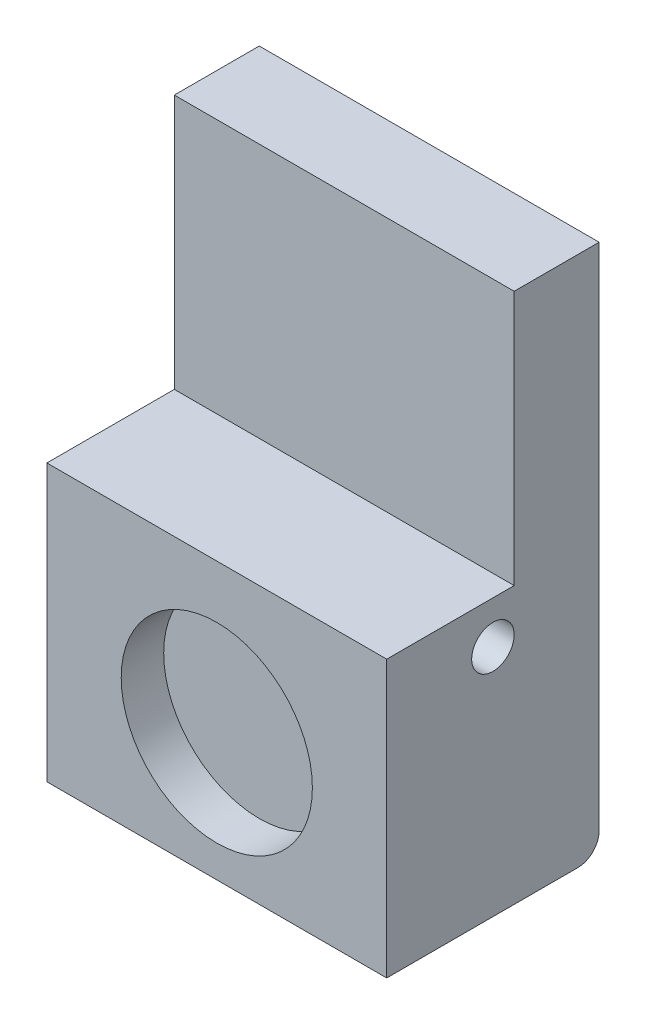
ISO-10303-21;
HEADER;
FILE_DESCRIPTION(('STEP AP214'),'2;1');
FILE_NAME('part.step','',(''),(''),'','','');
FILE_SCHEMA(('AUTOMOTIVE_DESIGN { 1 0 10303 214 1 1 1 1 }'));
ENDSEC;
DATA;
#1=APPLICATION_CONTEXT('core data for automotive mechanical design processes');
#2=APPLICATION_PROTOCOL_DEFINITION('international standard','automotive_design',2000,#1);
#3=PRODUCT_CONTEXT('',#1,'mechanical');
#4=PRODUCT('Part','Part','',(#3));
#5=PRODUCT_RELATED_PRODUCT_CATEGORY('part','',(#4));
#6=PRODUCT_DEFINITION_FORMATION('','',#4);
#7=PRODUCT_DEFINITION_CONTEXT('part definition',#1,'design');
#8=PRODUCT_DEFINITION('design','',#6,#7);
#9=PRODUCT_DEFINITION_SHAPE('','',#8);
#10=(LENGTH_UNIT() NAMED_UNIT(*) SI_UNIT(.MILLI.,.METRE.));
#11=(NAMED_UNIT(*) PLANE_ANGLE_UNIT() SI_UNIT($,.RADIAN.));
#12=(NAMED_UNIT(*) SI_UNIT($,.STERADIAN.) SOLID_ANGLE_UNIT());
#13=UNCERTAINTY_MEASURE_WITH_UNIT(LENGTH_MEASURE(1.E-05),#10,'distance_accuracy_value','');
#14=(GEOMETRIC_REPRESENTATION_CONTEXT(3) GLOBAL_UNCERTAINTY_ASSIGNED_CONTEXT((#13)) GLOBAL_UNIT_ASSIGNED_CONTEXT((#10,
#11,#12)) REPRESENTATION_CONTEXT('',''));
#15=CARTESIAN_POINT('',(0.,0.,0.));
#16=DIRECTION('',(0.,0.,1.));
#17=DIRECTION('',(1.,0.,0.));
#18=AXIS2_PLACEMENT_3D('',#15,#16,#17);
#19=CARTESIAN_POINT('',(62.9607,6.9705,14.5));
#20=DIRECTION('',(0.,-1.,0.));
#21=DIRECTION('',(0.,0.,-1.));
#22=AXIS2_PLACEMENT_3D('',#19,#20,#21);
#23=PLANE('',#22);
#24=DIRECTION('',(0.,0.,-1.));
#25=VECTOR('',#24,1.);
#26=CARTESIAN_POINT('',(78.9607,6.9705,14.5));
#27=LINE('',#26,#25);
#28=CARTESIAN_POINT('',(78.9607,6.9705,18.5));
#29=VERTEX_POINT('',#28);
#30=CARTESIAN_POINT('',(78.9607,6.9705,14.5));
#31=VERTEX_POINT('',#30);
#32=EDGE_CURVE('E119',#29,#31,#27,.T.);
#33=ORIENTED_EDGE('',*,*,#32,.T.);
#34=DIRECTION('',(1.,0.,0.));
#35=VECTOR('',#34,1.);
#36=CARTESIAN_POINT('',(62.9607,6.9705,14.5));
#37=LINE('',#36,#35);
#38=CARTESIAN_POINT('',(62.9607,6.9705,14.5));
#39=VERTEX_POINT('',#38);
#40=EDGE_CURVE('E102',#39,#31,#37,.T.);
#41=ORIENTED_EDGE('',*,*,#40,.F.);
#42=DIRECTION('',(0.,0.,-1.));
#43=VECTOR('',#42,1.);
#44=CARTESIAN_POINT('',(62.9607,6.9705,14.5));
#45=LINE('',#44,#43);
#46=CARTESIAN_POINT('',(62.9607,6.9705,18.5));
#47=VERTEX_POINT('',#46);
#48=EDGE_CURVE('E107',#47,#39,#45,.T.);
#49=ORIENTED_EDGE('',*,*,#48,.F.);
#50=DIRECTION('',(1.,0.,0.));
#51=VECTOR('',#50,1.);
#52=CARTESIAN_POINT('',(62.9607,6.9705,18.5));
#53=LINE('',#52,#51);
#54=EDGE_CURVE('E151',#47,#29,#53,.T.);
#55=ORIENTED_EDGE('',*,*,#54,.T.);
#56=EDGE_LOOP('',(#33,#41,#49,#55));
#57=FACE_BOUND('',#56,.T.);
#58=ADVANCED_FACE('F41',(#57),#23,.F.);
#59=CARTESIAN_POINT('',(62.9607,6.9705,14.5));
#60=DIRECTION('',(0.,0.,1.));
#61=DIRECTION('',(0.,-1.,0.));
#62=AXIS2_PLACEMENT_3D('',#59,#60,#61);
#63=PLANE('',#62);
#64=DIRECTION('',(0.,-1.,0.));
#65=VECTOR('',#64,1.);
#66=CARTESIAN_POINT('',(78.9607,6.9705,14.5));
#67=LINE('',#66,#65);
#68=CARTESIAN_POINT('',(78.9607,-17.0295,14.5));
#69=VERTEX_POINT('',#68);
#70=EDGE_CURVE('E136',#31,#69,#67,.T.);
#71=ORIENTED_EDGE('',*,*,#70,.T.);
#72=DIRECTION('',(1.,0.,0.));
#73=VECTOR('',#72,1.);
#74=CARTESIAN_POINT('',(62.9607,-17.0295,14.5));
#75=LINE('',#74,#73);
#76=CARTESIAN_POINT('',(62.9607,-17.0295,14.5));
#77=VERTEX_POINT('',#76);
#78=EDGE_CURVE('E50',#69,#77,#75,.F.);
#79=ORIENTED_EDGE('',*,*,#78,.T.);
#80=DIRECTION('',(0.,-1.,0.));
#81=VECTOR('',#80,1.);
#82=CARTESIAN_POINT('',(62.9607,6.9705,14.5));
#83=LINE('',#82,#81);
#84=EDGE_CURVE('E98',#39,#77,#83,.T.);
#85=ORIENTED_EDGE('',*,*,#84,.F.);
#86=ORIENTED_EDGE('',*,*,#40,.T.);
#87=EDGE_LOOP('',(#71,#79,#85,#86));
#88=FACE_BOUND('',#87,.T.);
#89=ADVANCED_FACE('F100',(#88),#63,.F.);
#90=CARTESIAN_POINT('',(62.9607,-18.0295,14.5));
#91=DIRECTION('',(0.,1.,0.));
#92=DIRECTION('',(0.,0.,1.));
#93=AXIS2_PLACEMENT_3D('',#90,#91,#92);
#94=PLANE('',#93);
#95=DIRECTION('',(0.,0.,1.));
#96=VECTOR('',#95,1.);
#97=CARTESIAN_POINT('',(62.9607,-18.0295,14.5));
#98=LINE('',#97,#96);
#99=CARTESIAN_POINT('',(62.9607,-18.0295,15.5));
#100=VERTEX_POINT('',#99);
#101=CARTESIAN_POINT('',(62.9607,-18.0295,24.5));
#102=VERTEX_POINT('',#101);
#103=EDGE_CURVE('E106',#100,#102,#98,.T.);
#104=ORIENTED_EDGE('',*,*,#103,.F.);
#105=DIRECTION('',(1.,0.,0.));
#106=VECTOR('',#105,1.);
#107=CARTESIAN_POINT('',(62.9607,-18.0295,15.5));
#108=LINE('',#107,#106);
#109=CARTESIAN_POINT('',(78.9607,-18.0295,15.5));
#110=VERTEX_POINT('',#109);
#111=EDGE_CURVE('E120',#100,#110,#108,.T.);
#112=ORIENTED_EDGE('',*,*,#111,.T.);
#113=DIRECTION('',(0.,0.,1.));
#114=VECTOR('',#113,1.);
#115=CARTESIAN_POINT('',(78.9607,-18.0295,14.5));
#116=LINE('',#115,#114);
#117=CARTESIAN_POINT('',(78.9607,-18.0295,24.5));
#118=VERTEX_POINT('',#117);
#119=EDGE_CURVE('E154',#110,#118,#116,.T.);
#120=ORIENTED_EDGE('',*,*,#119,.T.);
#121=DIRECTION('',(1.,0.,0.));
#122=VECTOR('',#121,1.);
#123=CARTESIAN_POINT('',(62.9607,-18.0295,24.5));
#124=LINE('',#123,#122);
#125=EDGE_CURVE('E121',#102,#118,#124,.T.);
#126=ORIENTED_EDGE('',*,*,#125,.F.);
#127=EDGE_LOOP('',(#104,#112,#120,#126));
#128=FACE_BOUND('',#127,.T.);
#129=ADVANCED_FACE('F194',(#128),#94,.F.);
#130=CARTESIAN_POINT('',(62.9607,-5.0295,24.5));
#131=DIRECTION('',(0.,0.,-1.));
#132=DIRECTION('',(-1.,0.,0.));
#133=AXIS2_PLACEMENT_3D('',#130,#131,#132);
#134=PLANE('',#133);
#135=CARTESIAN_POINT('',(70.9607,-12.0295,24.5));
#136=DIRECTION('',(0.,0.,-1.));
#137=DIRECTION('',(-1.,0.,0.));
#138=AXIS2_PLACEMENT_3D('',#135,#136,#137);
#139=CIRCLE('',#138,4.5);
#140=CARTESIAN_POINT('',(66.4607,-12.0295,24.5));
#141=VERTEX_POINT('',#140);
#142=EDGE_CURVE('E45',#141,#141,#139,.F.);
#143=ORIENTED_EDGE('',*,*,#142,.F.);
#144=EDGE_LOOP('',(#143));
#145=FACE_BOUND('',#144,.T.);
#146=DIRECTION('',(0.,1.,0.));
#147=VECTOR('',#146,1.);
#148=CARTESIAN_POINT('',(78.9607,-5.0295,24.5));
#149=LINE('',#148,#147);
#150=CARTESIAN_POINT('',(78.9607,-5.0295,24.5));
#151=VERTEX_POINT('',#150);
#152=EDGE_CURVE('E156',#118,#151,#149,.T.);
#153=ORIENTED_EDGE('',*,*,#152,.T.);
#154=DIRECTION('',(1.,0.,0.));
#155=VECTOR('',#154,1.);
#156=CARTESIAN_POINT('',(62.9607,-5.0295,24.5));
#157=LINE('',#156,#155);
#158=CARTESIAN_POINT('',(62.9607,-5.0295,24.5));
#159=VERTEX_POINT('',#158);
#160=EDGE_CURVE('E126',#159,#151,#157,.T.);
#161=ORIENTED_EDGE('',*,*,#160,.F.);
#162=DIRECTION('',(0.,1.,0.));
#163=VECTOR('',#162,1.);
#164=CARTESIAN_POINT('',(62.9607,-5.0295,24.5));
#165=LINE('',#164,#163);
#166=EDGE_CURVE('E147',#102,#159,#165,.T.);
#167=ORIENTED_EDGE('',*,*,#166,.F.);
#168=ORIENTED_EDGE('',*,*,#125,.T.);
#169=EDGE_LOOP('',(#153,#161,#167,#168));
#170=FACE_BOUND('',#169,.T.);
#171=ADVANCED_FACE('F186',(#145,#170),#134,.F.);
#172=CARTESIAN_POINT('',(62.9607,-5.0295,18.5));
#173=DIRECTION('',(0.,-1.,0.));
#174=DIRECTION('',(0.,0.,-1.));
#175=AXIS2_PLACEMENT_3D('',#172,#173,#174);
#176=PLANE('',#175);
#177=DIRECTION('',(0.,0.,-1.));
#178=VECTOR('',#177,1.);
#179=CARTESIAN_POINT('',(78.9607,-5.0295,18.5));
#180=LINE('',#179,#178);
#181=CARTESIAN_POINT('',(78.9607,-5.0295,18.5));
#182=VERTEX_POINT('',#181);
#183=EDGE_CURVE('E158',#151,#182,#180,.T.);
#184=ORIENTED_EDGE('',*,*,#183,.T.);
#185=DIRECTION('',(1.,0.,0.));
#186=VECTOR('',#185,1.);
#187=CARTESIAN_POINT('',(62.9607,-5.0295,18.5));
#188=LINE('',#187,#186);
#189=CARTESIAN_POINT('',(62.9607,-5.0295,18.5));
#190=VERTEX_POINT('',#189);
#191=EDGE_CURVE('E162',#190,#182,#188,.T.);
#192=ORIENTED_EDGE('',*,*,#191,.F.);
#193=DIRECTION('',(0.,0.,-1.));
#194=VECTOR('',#193,1.);
#195=CARTESIAN_POINT('',(62.9607,-5.0295,18.5));
#196=LINE('',#195,#194);
#197=EDGE_CURVE('E149',#159,#190,#196,.T.);
#198=ORIENTED_EDGE('',*,*,#197,.F.);
#199=ORIENTED_EDGE('',*,*,#160,.T.);
#200=EDGE_LOOP('',(#184,#192,#198,#199));
#201=FACE_BOUND('',#200,.T.);
#202=ADVANCED_FACE('F169',(#201),#176,.F.);
#203=CARTESIAN_POINT('',(62.9607,6.9705,18.5));
#204=DIRECTION('',(0.,0.,-1.));
#205=DIRECTION('',(-1.,0.,0.));
#206=AXIS2_PLACEMENT_3D('',#203,#204,#205);
#207=PLANE('',#206);
#208=DIRECTION('',(0.,1.,0.));
#209=VECTOR('',#208,1.);
#210=CARTESIAN_POINT('',(78.9607,6.9705,18.5));
#211=LINE('',#210,#209);
#212=EDGE_CURVE('E116',#182,#29,#211,.T.);
#213=ORIENTED_EDGE('',*,*,#212,.T.);
#214=ORIENTED_EDGE('',*,*,#54,.F.);
#215=DIRECTION('',(0.,1.,0.));
#216=VECTOR('',#215,1.);
#217=CARTESIAN_POINT('',(62.9607,6.9705,18.5));
#218=LINE('',#217,#216);
#219=EDGE_CURVE('E112',#190,#47,#218,.T.);
#220=ORIENTED_EDGE('',*,*,#219,.F.);
#221=ORIENTED_EDGE('',*,*,#191,.T.);
#222=EDGE_LOOP('',(#213,#214,#220,#221));
#223=FACE_BOUND('',#222,.T.);
#224=ADVANCED_FACE('F177',(#223),#207,.F.);
#225=CARTESIAN_POINT('',(62.9607,0.,0.));
#226=DIRECTION('',(1.,0.,0.));
#227=DIRECTION('',(0.,0.,-1.));
#228=AXIS2_PLACEMENT_3D('',#225,#226,#227);
#229=PLANE('',#228);
#230=ORIENTED_EDGE('',*,*,#84,.T.);
#231=CARTESIAN_POINT('',(62.9607,-17.0295,15.5));
#232=DIRECTION('',(1.,0.,0.));
#233=DIRECTION('',(0.,0.,-1.));
#234=AXIS2_PLACEMENT_3D('',#231,#232,#233);
#235=CIRCLE('',#234,1.);
#236=EDGE_CURVE('E11',#77,#100,#235,.F.);
#237=ORIENTED_EDGE('',*,*,#236,.T.);
#238=ORIENTED_EDGE('',*,*,#103,.T.);
#239=ORIENTED_EDGE('',*,*,#166,.T.);
#240=ORIENTED_EDGE('',*,*,#197,.T.);
#241=ORIENTED_EDGE('',*,*,#219,.T.);
#242=ORIENTED_EDGE('',*,*,#48,.T.);
#243=EDGE_LOOP('',(#230,#237,#238,#239,#240,#241,#242));
#244=FACE_BOUND('',#243,.T.);
#245=ADVANCED_FACE('F110',(#244),#229,.F.);
#246=CARTESIAN_POINT('',(78.9607,0.,0.));
#247=DIRECTION('',(1.,0.,0.));
#248=DIRECTION('',(0.,0.,-1.));
#249=AXIS2_PLACEMENT_3D('',#246,#247,#248);
#250=PLANE('',#249);
#251=CARTESIAN_POINT('',(78.9607,-7.0295,19.5));
#252=DIRECTION('',(1.,0.,0.));
#253=DIRECTION('',(0.,0.,-1.));
#254=AXIS2_PLACEMENT_3D('',#251,#252,#253);
#255=CIRCLE('',#254,1.);
#256=CARTESIAN_POINT('',(78.9607,-7.0295,18.5));
#257=VERTEX_POINT('',#256);
#258=EDGE_CURVE('E131',#257,#257,#255,.T.);
#259=ORIENTED_EDGE('',*,*,#258,.F.);
#260=EDGE_LOOP('',(#259));
#261=FACE_BOUND('',#260,.T.);
#262=ORIENTED_EDGE('',*,*,#119,.F.);
#263=CARTESIAN_POINT('',(78.9607,-17.0295,15.5));
#264=DIRECTION('',(1.,0.,0.));
#265=DIRECTION('',(0.,0.,-1.));
#266=AXIS2_PLACEMENT_3D('',#263,#264,#265);
#267=CIRCLE('',#266,1.);
#268=EDGE_CURVE('E65',#110,#69,#267,.T.);
#269=ORIENTED_EDGE('',*,*,#268,.T.);
#270=ORIENTED_EDGE('',*,*,#70,.F.);
#271=ORIENTED_EDGE('',*,*,#32,.F.);
#272=ORIENTED_EDGE('',*,*,#212,.F.);
#273=ORIENTED_EDGE('',*,*,#183,.F.);
#274=ORIENTED_EDGE('',*,*,#152,.F.);
#275=EDGE_LOOP('',(#262,#269,#270,#271,#272,#273,#274));
#276=FACE_BOUND('',#275,.T.);
#277=ADVANCED_FACE('F175',(#261,#276),#250,.T.);
#278=CARTESIAN_POINT('',(62.9607,-17.0295,15.5));
#279=DIRECTION('',(1.,0.,0.));
#280=DIRECTION('',(0.,0.,-1.));
#281=AXIS2_PLACEMENT_3D('',#278,#279,#280);
#282=CYLINDRICAL_SURFACE('',#281,1.);
#283=ORIENTED_EDGE('',*,*,#236,.F.);
#284=ORIENTED_EDGE('',*,*,#78,.F.);
#285=ORIENTED_EDGE('',*,*,#268,.F.);
#286=ORIENTED_EDGE('',*,*,#111,.F.);
#287=EDGE_LOOP('',(#283,#284,#285,#286));
#288=FACE_BOUND('',#287,.T.);
#289=ADVANCED_FACE('F43',(#288),#282,.T.);
#290=CARTESIAN_POINT('',(73.9607,-7.0295,19.5));
#291=DIRECTION('',(1.,0.,0.));
#292=DIRECTION('',(0.,0.,-1.));
#293=AXIS2_PLACEMENT_3D('',#290,#291,#292);
#294=CYLINDRICAL_SURFACE('',#293,1.);
#295=ORIENTED_EDGE('',*,*,#258,.T.);
#296=EDGE_LOOP('',(#295));
#297=FACE_BOUND('',#296,.T.);
#298=CARTESIAN_POINT('',(73.9607,-7.0295,19.5));
#299=DIRECTION('',(1.,0.,0.));
#300=DIRECTION('',(0.,0.,-1.));
#301=AXIS2_PLACEMENT_3D('',#298,#299,#300);
#302=CIRCLE('',#301,1.);
#303=CARTESIAN_POINT('',(73.9607,-7.0295,18.5));
#304=VERTEX_POINT('',#303);
#305=EDGE_CURVE('E133',#304,#304,#302,.T.);
#306=ORIENTED_EDGE('',*,*,#305,.F.);
#307=EDGE_LOOP('',(#306));
#308=FACE_BOUND('',#307,.T.);
#309=ADVANCED_FACE('F211',(#297,#308),#294,.F.);
#310=CARTESIAN_POINT('',(73.9607,-7.0295,19.5));
#311=DIRECTION('',(1.,0.,0.));
#312=DIRECTION('',(0.,0.,-1.));
#313=AXIS2_PLACEMENT_3D('',#310,#311,#312);
#314=PLANE('',#313);
#315=ORIENTED_EDGE('',*,*,#305,.T.);
#316=EDGE_LOOP('',(#315));
#317=FACE_BOUND('',#316,.T.);
#318=ADVANCED_FACE('F217',(#317),#314,.T.);
#319=CARTESIAN_POINT('',(70.9607,-12.0295,44.2279220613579));
#320=DIRECTION('',(0.,0.,-1.));
#321=DIRECTION('',(-1.,0.,0.));
#322=AXIS2_PLACEMENT_3D('',#319,#320,#321);
#323=CYLINDRICAL_SURFACE('',#322,4.5);
#324=CARTESIAN_POINT('',(70.9607,-12.0295,22.5));
#325=DIRECTION('',(0.,0.,1.));
#326=DIRECTION('',(1.,0.,0.));
#327=AXIS2_PLACEMENT_3D('',#324,#325,#326);
#328=CIRCLE('',#327,4.5);
#329=CARTESIAN_POINT('',(75.4607,-12.0295,22.5));
#330=VERTEX_POINT('',#329);
#331=EDGE_CURVE('E143',#330,#330,#328,.T.);
#332=ORIENTED_EDGE('',*,*,#331,.F.);
#333=EDGE_LOOP('',(#332));
#334=FACE_BOUND('',#333,.T.);
#335=ORIENTED_EDGE('',*,*,#142,.T.);
#336=EDGE_LOOP('',(#335));
#337=FACE_BOUND('',#336,.T.);
#338=ADVANCED_FACE('F226',(#334,#337),#323,.F.);
#339=CARTESIAN_POINT('',(70.9607,-12.0295,22.5));
#340=DIRECTION('',(0.,0.,1.));
#341=DIRECTION('',(1.,0.,0.));
#342=AXIS2_PLACEMENT_3D('',#339,#340,#341);
#343=PLANE('',#342);
#344=ORIENTED_EDGE('',*,*,#331,.T.);
#345=EDGE_LOOP('',(#344));
#346=FACE_BOUND('',#345,.T.);
#347=ADVANCED_FACE('F229',(#346),#343,.T.);
#348=CLOSED_SHELL('',(#58,#89,#129,#171,#202,#224,#245,#277,#289,#309,#318,#338,#347));
#349=MANIFOLD_SOLID_BREP('B2',#348);
#350=ADVANCED_BREP_SHAPE_REPRESENTATION('',(#18,#349),#14);
#351=SHAPE_DEFINITION_REPRESENTATION(#9,#350);
ENDSEC;
END-ISO-10303-21;
